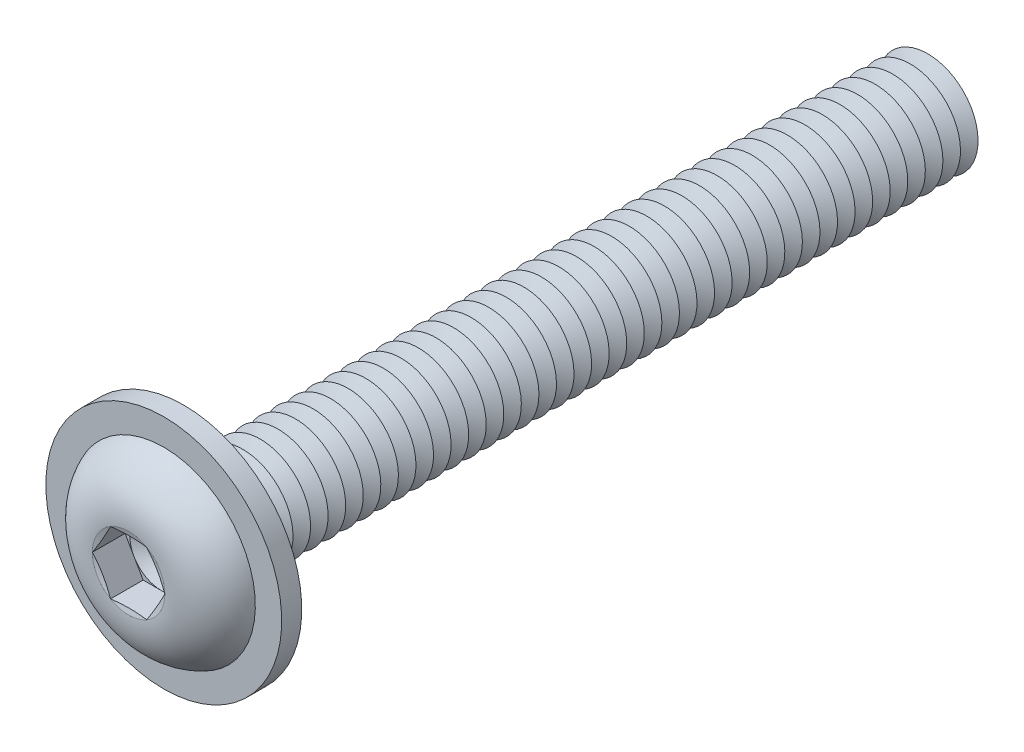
from build123d import *

# Parameters (mm, degrees)
FILLET1_R           = 0.35
LPATTERN1_COUNT     = 42
LPATTERN1_PITCH     = 0.7
CUT_EXTRUDE1_DEPTH  = 1.3
SKETCH5_R           = 4.7
SKETCH5_R_2         = 2.35
BOSS_EXTRUDE1_DEPTH = 0.8


with BuildPart() as part:
    # Sketch1 → Revolve1 (revolve)
    with BuildSketch(Plane(origin=(0, 0, 0), x_dir=(0, 0, -1), z_dir=(1, 0, 0))):
        with BuildLine():
            Line((0, 2), (0, 3.8))
            ThreePointArc((0, 3.8), (-1.611961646, 3.099623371), (-2.2, 1.443375))
            Line((-2.2, 1.443375), (-2.006624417, 0.7216875))
            Line((-2.006624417, 0.7216875), (-2.2, 0.7216875))
            Line((-2.2, 0.7216875), (-2.2, 0))
            Line((-2.2, 0), (30, 0))
            Line((30, 0), (30, 2))
            Line((30, 2), (0, 2))
        make_face()
    revolve(axis=Axis((0, 0, -30), (0, 0, 1)))

    # Fillet1
    fillet1_edges = [part.edges().sort_by_distance(p)[0] for p in [
        (0, -2, 0),
    ]]
    fillet(fillet1_edges, radius=FILLET1_R)

    # Sketch2 → Cut-Revolve1 (revolve, cut)
    with BuildSketch(Plane(origin=(0, 0, 0), x_dir=(0, 0, -1), z_dir=(1, 0, 0))):
        Polygon((29.65, 2), (30.35, 2), (30, 1.393782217), align=None)
    cut_revolve1 = revolve(axis=Axis((0, 0, -30), (0, 0, -1)), mode=Mode.SUBTRACT)

    # LPattern1: Cut-Revolve1 ×42
    with Locations(*[(0, 0, i * LPATTERN1_PITCH) for i in range(1, LPATTERN1_COUNT)]):
        add(cut_revolve1, mode=Mode.SUBTRACT)

    # Sketch3 → Cut-Extrude1 (cut)
    with BuildSketch(Plane.XY.offset(2.2)):
        Polygon((0.7216875, 1.249999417), (-0.7216875, 1.249999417), (-1.443375, 0), (-0.7216875, -1.249999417), (0.7216875, -1.249999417), (1.443375, 0), align=None)
    extrude(amount=-CUT_EXTRUDE1_DEPTH, mode=Mode.SUBTRACT)

    # Cut-Extrude2 cone 1 section (on through the dimple's axis) → Cut-Extrude2 (revolve, cut)
    with BuildSketch(Plane(origin=(0, 0, 0.9), x_dir=(0, -1, 0), z_dir=(1, 0, 0))):
        Polygon((0, 0), (1.249999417, 0), (0, 0.7216875), align=None)
    revolve(axis=Axis((0, 0, 0.9), (0, 0, -1)), mode=Mode.SUBTRACT)

    # Sketch5 → Boss-Extrude1 (add)
    with BuildSketch(Plane(origin=(0, 0, 0), x_dir=(-1, 0, 0), z_dir=(0, 0, -1))):
        with Locations(Location((0, 0, 0), (0, 0, 90))):
            Circle(SKETCH5_R)
        Circle(SKETCH5_R_2, mode=Mode.SUBTRACT)
    extrude(amount=-BOSS_EXTRUDE1_DEPTH)


solid = part.part
